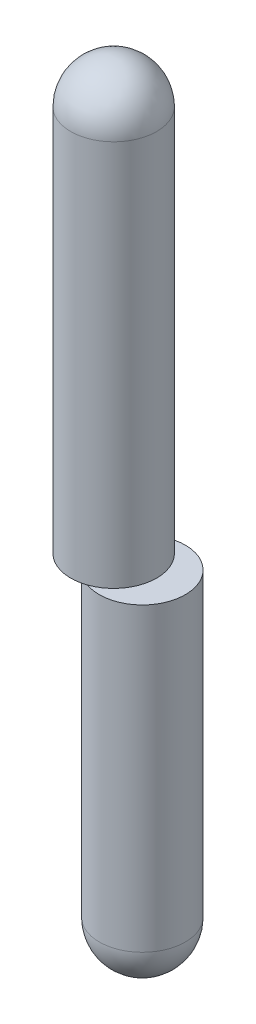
ISO-10303-21;
HEADER;
FILE_DESCRIPTION(('STEP AP214'),'2;1');
FILE_NAME('part.step','',(''),(''),'','','');
FILE_SCHEMA(('AUTOMOTIVE_DESIGN { 1 0 10303 214 1 1 1 1 }'));
ENDSEC;
DATA;
#1=APPLICATION_CONTEXT('core data for automotive mechanical design processes');
#2=APPLICATION_PROTOCOL_DEFINITION('international standard','automotive_design',2000,#1);
#3=PRODUCT_CONTEXT('',#1,'mechanical');
#4=PRODUCT('Part','Part','',(#3));
#5=PRODUCT_RELATED_PRODUCT_CATEGORY('part','',(#4));
#6=PRODUCT_DEFINITION_FORMATION('','',#4);
#7=PRODUCT_DEFINITION_CONTEXT('part definition',#1,'design');
#8=PRODUCT_DEFINITION('design','',#6,#7);
#9=PRODUCT_DEFINITION_SHAPE('','',#8);
#10=(LENGTH_UNIT() NAMED_UNIT(*) SI_UNIT(.MILLI.,.METRE.));
#11=(NAMED_UNIT(*) PLANE_ANGLE_UNIT() SI_UNIT($,.RADIAN.));
#12=(NAMED_UNIT(*) SI_UNIT($,.STERADIAN.) SOLID_ANGLE_UNIT());
#13=UNCERTAINTY_MEASURE_WITH_UNIT(LENGTH_MEASURE(1.E-05),#10,'distance_accuracy_value','');
#14=(GEOMETRIC_REPRESENTATION_CONTEXT(3) GLOBAL_UNCERTAINTY_ASSIGNED_CONTEXT((#13)) GLOBAL_UNIT_ASSIGNED_CONTEXT((#10,
#11,#12)) REPRESENTATION_CONTEXT('',''));
#15=CARTESIAN_POINT('',(0.,0.,0.));
#16=DIRECTION('',(0.,0.,1.));
#17=DIRECTION('',(1.,0.,0.));
#18=AXIS2_PLACEMENT_3D('',#15,#16,#17);
#19=CARTESIAN_POINT('',(-85.57,0.,0.));
#20=DIRECTION('',(0.,1.,0.));
#21=DIRECTION('',(-1.,0.,0.));
#22=AXIS2_PLACEMENT_3D('',#19,#20,#21);
#23=PLANE('',#22);
#24=CARTESIAN_POINT('',(-85.57,0.,0.));
#25=DIRECTION('',(0.,1.,0.));
#26=DIRECTION('',(-1.,0.,0.));
#27=AXIS2_PLACEMENT_3D('',#24,#25,#26);
#28=CIRCLE('',#27,1.4925);
#29=CARTESIAN_POINT('',(-86.0675,0.,1.40714249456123));
#30=VERTEX_POINT('',#29);
#31=CARTESIAN_POINT('',(-86.0675,0.,-1.40714249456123));
#32=VERTEX_POINT('',#31);
#33=EDGE_CURVE('E52',#30,#32,#28,.T.);
#34=ORIENTED_EDGE('',*,*,#33,.T.);
#35=CARTESIAN_POINT('',(-86.565,0.,0.));
#36=DIRECTION('',(0.,-1.,0.));
#37=DIRECTION('',(1.,0.,0.));
#38=AXIS2_PLACEMENT_3D('',#35,#36,#37);
#39=CIRCLE('',#38,1.4925);
#40=EDGE_CURVE('E11',#32,#30,#39,.T.);
#41=ORIENTED_EDGE('',*,*,#40,.T.);
#42=EDGE_LOOP('',(#34,#41));
#43=FACE_BOUND('',#42,.T.);
#44=ADVANCED_FACE('F16',(#43),#23,.T.);
#45=CARTESIAN_POINT('',(-85.57,-11.94,0.));
#46=DIRECTION('',(0.,1.,0.));
#47=DIRECTION('',(-1.,0.,0.));
#48=AXIS2_PLACEMENT_3D('',#45,#46,#47);
#49=CYLINDRICAL_SURFACE('',#48,1.4925);
#50=CARTESIAN_POINT('',(-85.57,-10.4475,0.));
#51=DIRECTION('',(0.,1.,0.));
#52=DIRECTION('',(0.,0.,-1.));
#53=AXIS2_PLACEMENT_3D('',#50,#51,#52);
#54=CIRCLE('',#53,1.4925);
#55=CARTESIAN_POINT('',(-85.57,-10.4475,-1.4925));
#56=VERTEX_POINT('',#55);
#57=EDGE_CURVE('E20',#56,#56,#54,.T.);
#58=ORIENTED_EDGE('',*,*,#57,.T.);
#59=EDGE_LOOP('',(#58));
#60=FACE_BOUND('',#59,.T.);
#61=ORIENTED_EDGE('',*,*,#33,.F.);
#62=EDGE_CURVE('E49',#32,#30,#28,.T.);
#63=ORIENTED_EDGE('',*,*,#62,.F.);
#64=EDGE_LOOP('',(#61,#63));
#65=FACE_BOUND('',#64,.T.);
#66=ADVANCED_FACE('F18',(#60,#65),#49,.T.);
#67=CARTESIAN_POINT('',(-85.57,-10.4475,0.));
#68=DIRECTION('',(0.,0.,1.));
#69=DIRECTION('',(-1.,0.,0.));
#70=AXIS2_PLACEMENT_3D('',#67,#68,#69);
#71=SPHERICAL_SURFACE('',#70,1.4925);
#72=CARTESIAN_POINT('',(-85.57,-10.4475,0.));
#73=DIRECTION('',(0.,1.,0.));
#74=DIRECTION('',(0.,0.,-1.));
#75=AXIS2_PLACEMENT_3D('',#72,#73,#74);
#76=SPHERICAL_SURFACE('',#75,1.4925);
#77=ORIENTED_EDGE('',*,*,#57,.F.);
#78=EDGE_LOOP('',(#77));
#79=FACE_BOUND('',#78,.T.);
#80=ADVANCED_FACE('F97',(#79),#76,.T.);
#81=CARTESIAN_POINT('',(-86.565,14.925,0.));
#82=DIRECTION('',(0.,-1.,0.));
#83=DIRECTION('',(1.,0.,0.));
#84=AXIS2_PLACEMENT_3D('',#81,#82,#83);
#85=CYLINDRICAL_SURFACE('',#84,1.4925);
#86=CARTESIAN_POINT('',(-86.565,13.4325,0.));
#87=DIRECTION('',(0.,-1.,0.));
#88=DIRECTION('',(0.,0.,-1.));
#89=AXIS2_PLACEMENT_3D('',#86,#87,#88);
#90=CIRCLE('',#89,1.4925);
#91=CARTESIAN_POINT('',(-86.565,13.4325,-1.4925));
#92=VERTEX_POINT('',#91);
#93=EDGE_CURVE('E50',#92,#92,#90,.T.);
#94=ORIENTED_EDGE('',*,*,#93,.T.);
#95=EDGE_LOOP('',(#94));
#96=FACE_BOUND('',#95,.T.);
#97=EDGE_CURVE('E27',#30,#32,#39,.T.);
#98=ORIENTED_EDGE('',*,*,#97,.F.);
#99=ORIENTED_EDGE('',*,*,#40,.F.);
#100=EDGE_LOOP('',(#98,#99));
#101=FACE_BOUND('',#100,.T.);
#102=ADVANCED_FACE('F34',(#96,#101),#85,.T.);
#103=CARTESIAN_POINT('',(-86.565,0.,0.));
#104=DIRECTION('',(0.,-1.,0.));
#105=DIRECTION('',(1.,0.,0.));
#106=AXIS2_PLACEMENT_3D('',#103,#104,#105);
#107=PLANE('',#106);
#108=ORIENTED_EDGE('',*,*,#97,.T.);
#109=ORIENTED_EDGE('',*,*,#62,.T.);
#110=EDGE_LOOP('',(#108,#109));
#111=FACE_BOUND('',#110,.T.);
#112=ADVANCED_FACE('F47',(#111),#107,.T.);
#113=CARTESIAN_POINT('',(-86.565,13.4325,0.));
#114=DIRECTION('',(0.,0.,1.));
#115=DIRECTION('',(1.,0.,0.));
#116=AXIS2_PLACEMENT_3D('',#113,#114,#115);
#117=SPHERICAL_SURFACE('',#116,1.4925);
#118=CARTESIAN_POINT('',(-86.565,13.4325,0.));
#119=DIRECTION('',(0.,-1.,0.));
#120=DIRECTION('',(0.,0.,-1.));
#121=AXIS2_PLACEMENT_3D('',#118,#119,#120);
#122=SPHERICAL_SURFACE('',#121,1.4925);
#123=ORIENTED_EDGE('',*,*,#93,.F.);
#124=EDGE_LOOP('',(#123));
#125=FACE_BOUND('',#124,.T.);
#126=ADVANCED_FACE('F83',(#125),#122,.T.);
#127=CLOSED_SHELL('',(#44,#66,#80,#102,#112,#126));
#128=MANIFOLD_SOLID_BREP('B1',#127);
#129=ADVANCED_BREP_SHAPE_REPRESENTATION('',(#18,#128),#14);
#130=SHAPE_DEFINITION_REPRESENTATION(#9,#129);
ENDSEC;
END-ISO-10303-21;
